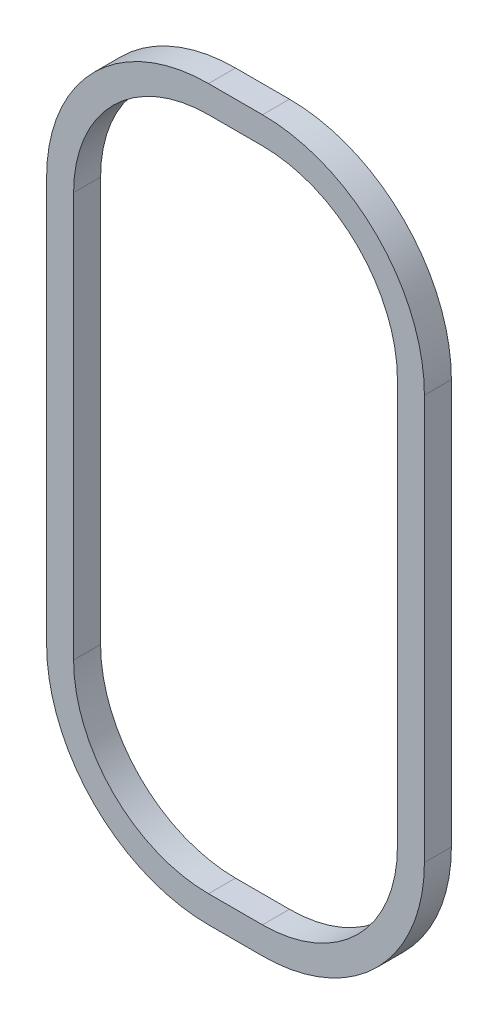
from build123d import *

# Parameters (mm, degrees)
BOSS_EXTRU_1_DEPTH = 1


with BuildPart() as part:
    # Esquisse1 → Boss.-Extru.1 (new body)
    with BuildSketch(Plane.XY):
        with BuildLine():
            Line((5, 26), (7, 26))
            ThreePointArc((7, 26), (11.242640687, 24.242640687), (13, 20))
            Line((13, 20), (13, 5))
            ThreePointArc((13, 5), (11.242640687, 0.757359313), (7, -1))
            Line((7, -1), (5, -1))
            ThreePointArc((5, -1), (0.757359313, 0.757359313), (-1, 5))
            Line((-1, 5), (-1, 20))
            ThreePointArc((-1, 20), (0.757359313, 24.242640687), (5, 26))
        make_face()
        with BuildLine():
            Line((5, 0), (7, 0))
            ThreePointArc((7, 0), (10.535533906, 1.464466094), (12, 5))
            Line((12, 5), (12, 20))
            ThreePointArc((12, 20), (10.535533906, 23.535533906), (7, 25))
            Line((7, 25), (5, 25))
            ThreePointArc((5, 25), (1.464466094, 23.535533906), (0, 20))
            Line((0, 20), (0, 5))
            ThreePointArc((0, 5), (1.464466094, 1.464466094), (5, 0))
        make_face(mode=Mode.SUBTRACT)
    extrude(amount=BOSS_EXTRU_1_DEPTH)


solid = part.part
